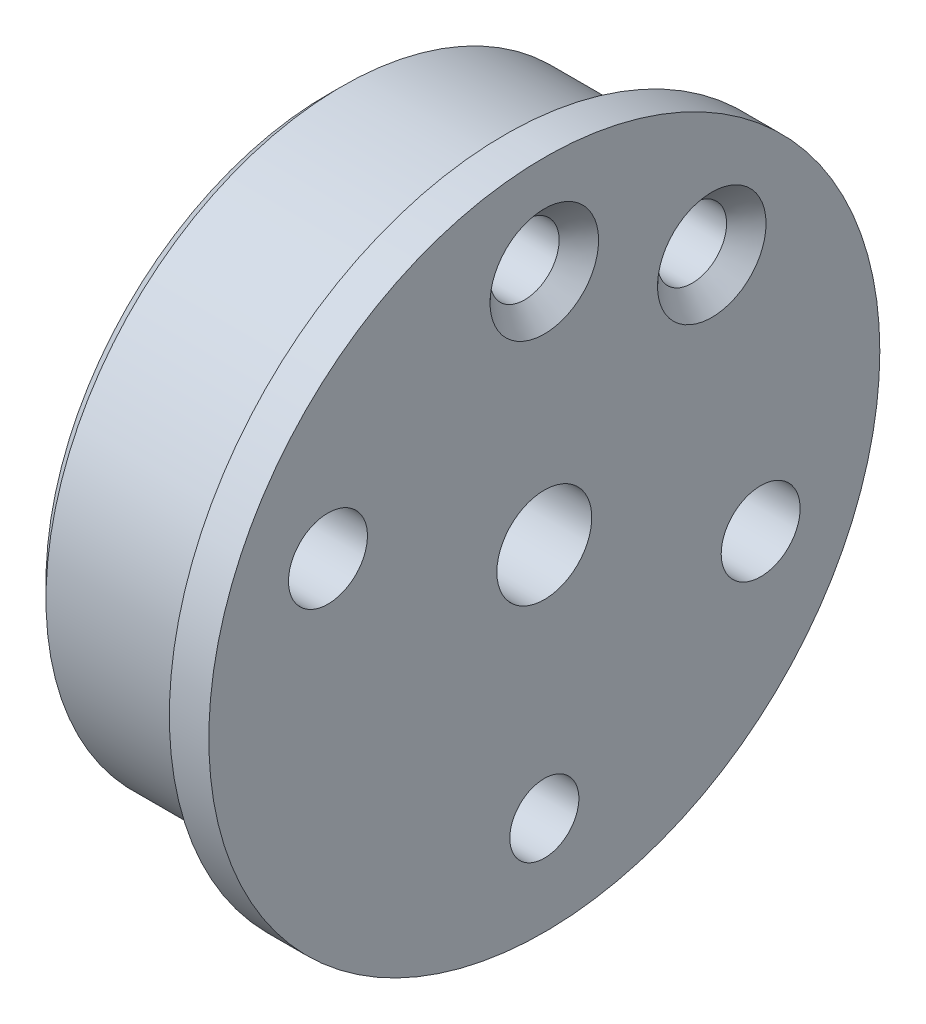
from build123d import *

# Parameters (mm, degrees)
ESQUISSE2_R             = 4.807887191
ESQUISSE2_R_2           = 4
ESQUISSE2_R_3           = 3.5
ENL_V_MAT_EXTRU_1_DEPTH = 53.877216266
CHANFREIN1_SIZE         = 2


with BuildPart() as part:
    # Esquisse1 → R_volution1 (revolve)
    with BuildSketch(Plane.XY, mode=Mode.PRIVATE) as r_volution1_sk:
        Polygon((0, 0), (0, 34), (-4, 34), (-4, 30), (-20.5, 30), (-22, 28.5), (-22, 0), align=None)
    revolve(r_volution1_sk.sketch.rotate(Axis((21.586023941, 0, 0), (-1, 0, 0)), 90), axis=Axis((21.586023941, 0, 0), (-1, 0, 0)))

    # Esquisse2 → Enl_v. mat.-Extru.1 (cut, through all)
    with BuildSketch(Plane.ZY.offset(22)):
        Circle(ESQUISSE2_R)
        with Locations((21.925090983, 9.761679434)):
            Circle(ESQUISSE2_R_2)
        with Locations((-21.925090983, -9.761679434)):
            Circle(ESQUISSE2_R_2)
        with Locations((0, 24)):
            Circle(ESQUISSE2_R_3)
        with Locations((-16.970562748, 16.970562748)):
            Circle(ESQUISSE2_R_3)
        with Locations((0, -24)):
            Circle(ESQUISSE2_R_3)
    extrude(amount=-ENL_V_MAT_EXTRU_1_DEPTH, mode=Mode.SUBTRACT)

    # Chanfrein1
    chanfrein1_edges = [part.edges().sort_by_distance(p)[0] for p in [
        (0, 24, -3.5),
        (0, 16.970562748, -20.470562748),
    ]]
    chamfer(chanfrein1_edges, length=CHANFREIN1_SIZE)


solid = part.part
